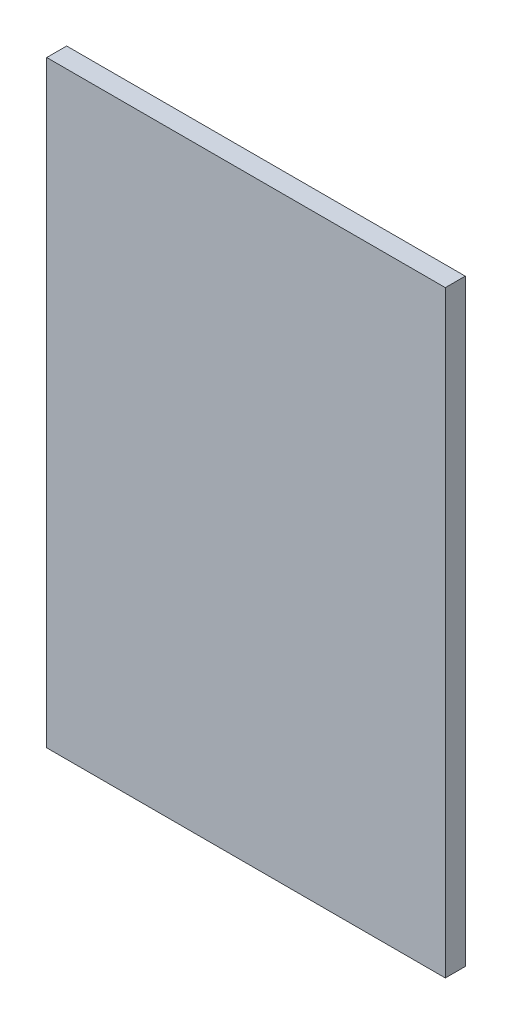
from build123d import *

# Parameters (mm, degrees)
SZKIC1_W                    = 100
SZKIC1_H                    = 150
DODANIE_WYCI_GNI_CIE1_DEPTH = 5


with BuildPart() as part:
    # Szkic1 → Dodanie-wyci_gni_cie1 (new body)
    with BuildSketch(Plane.XY):
        with Locations((50, 75)):
            Rectangle(SZKIC1_W, SZKIC1_H)
    extrude(amount=DODANIE_WYCI_GNI_CIE1_DEPTH)


solid = part.part
